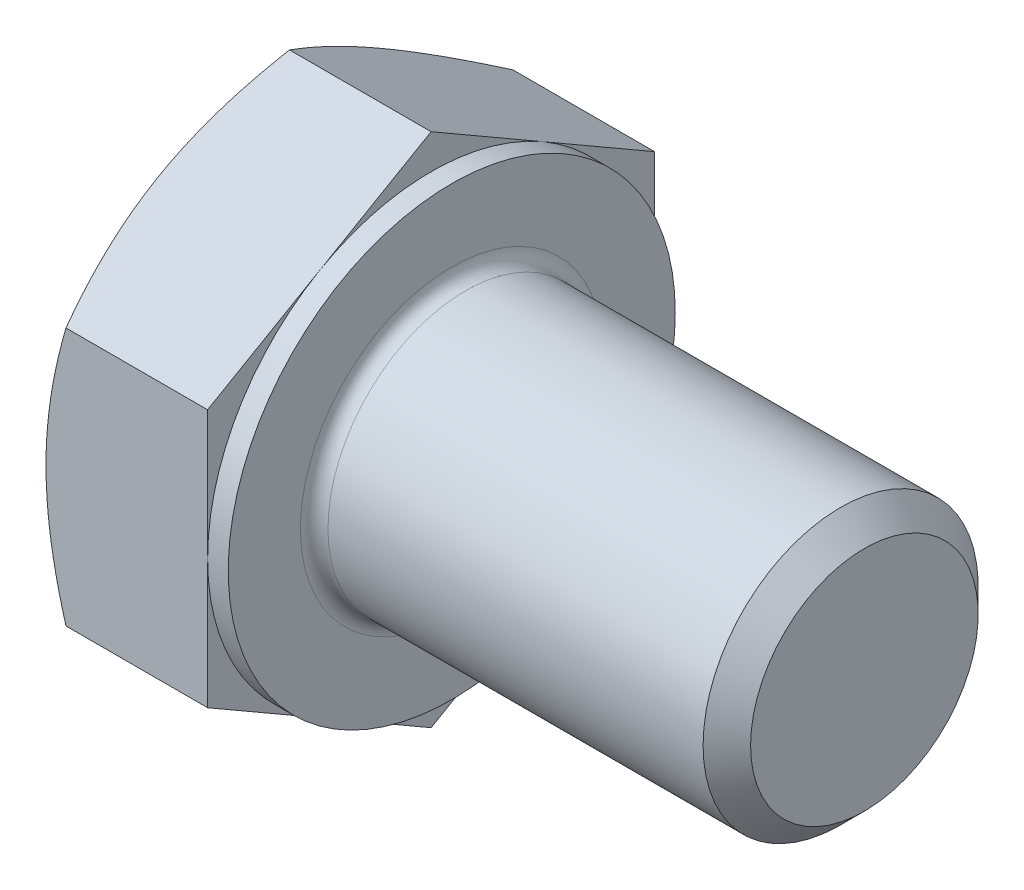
ISO-10303-21;
HEADER;
FILE_DESCRIPTION(('STEP AP214'),'2;1');
FILE_NAME('part.step','',(''),(''),'','','');
FILE_SCHEMA(('AUTOMOTIVE_DESIGN { 1 0 10303 214 1 1 1 1 }'));
ENDSEC;
DATA;
#1=APPLICATION_CONTEXT('core data for automotive mechanical design processes');
#2=APPLICATION_PROTOCOL_DEFINITION('international standard','automotive_design',2000,#1);
#3=PRODUCT_CONTEXT('',#1,'mechanical');
#4=PRODUCT('Part','Part','',(#3));
#5=PRODUCT_RELATED_PRODUCT_CATEGORY('part','',(#4));
#6=PRODUCT_DEFINITION_FORMATION('','',#4);
#7=PRODUCT_DEFINITION_CONTEXT('part definition',#1,'design');
#8=PRODUCT_DEFINITION('design','',#6,#7);
#9=PRODUCT_DEFINITION_SHAPE('','',#8);
#10=(LENGTH_UNIT() NAMED_UNIT(*) SI_UNIT(.MILLI.,.METRE.));
#11=(NAMED_UNIT(*) PLANE_ANGLE_UNIT() SI_UNIT($,.RADIAN.));
#12=(NAMED_UNIT(*) SI_UNIT($,.STERADIAN.) SOLID_ANGLE_UNIT());
#13=UNCERTAINTY_MEASURE_WITH_UNIT(LENGTH_MEASURE(1.E-05),#10,'distance_accuracy_value','');
#14=(GEOMETRIC_REPRESENTATION_CONTEXT(3) GLOBAL_UNCERTAINTY_ASSIGNED_CONTEXT((#13)) GLOBAL_UNIT_ASSIGNED_CONTEXT((#10,
#11,#12)) REPRESENTATION_CONTEXT('',''));
#15=CARTESIAN_POINT('',(0.,0.,0.));
#16=DIRECTION('',(0.,0.,1.));
#17=DIRECTION('',(1.,0.,0.));
#18=AXIS2_PLACEMENT_3D('',#15,#16,#17);
#19=CARTESIAN_POINT('',(5.3,7.50555349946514,0.));
#20=DIRECTION('',(1.,0.,0.));
#21=DIRECTION('',(0.,0.,-1.));
#22=AXIS2_PLACEMENT_3D('',#19,#20,#21);
#23=PLANE('',#22);
#24=CARTESIAN_POINT('',(5.3,0.,0.));
#25=DIRECTION('',(1.,0.,0.));
#26=DIRECTION('',(0.,0.,-1.));
#27=AXIS2_PLACEMENT_3D('',#24,#25,#26);
#28=CIRCLE('',#27,4.4);
#29=CARTESIAN_POINT('',(5.3,0.,-4.4));
#30=VERTEX_POINT('',#29);
#31=EDGE_CURVE('E43',#30,#30,#28,.F.);
#32=ORIENTED_EDGE('',*,*,#31,.T.);
#33=EDGE_LOOP('',(#32));
#34=FACE_BOUND('',#33,.T.);
#35=CARTESIAN_POINT('',(5.3,0.,0.));
#36=DIRECTION('',(1.,0.,0.));
#37=DIRECTION('',(0.,0.,-1.));
#38=AXIS2_PLACEMENT_3D('',#35,#36,#37);
#39=CIRCLE('',#38,6.5);
#40=CARTESIAN_POINT('',(5.3,0.,-6.5));
#41=VERTEX_POINT('',#40);
#42=EDGE_CURVE('E256',#41,#41,#39,.T.);
#43=ORIENTED_EDGE('',*,*,#42,.T.);
#44=EDGE_LOOP('',(#43));
#45=FACE_BOUND('',#44,.T.);
#46=ADVANCED_FACE('F34',(#34,#45),#23,.T.);
#47=CARTESIAN_POINT('',(0.,0.,0.));
#48=DIRECTION('',(-1.,0.,0.));
#49=DIRECTION('',(0.,0.,1.));
#50=AXIS2_PLACEMENT_3D('',#47,#48,#49);
#51=CYLINDRICAL_SURFACE('',#50,4.);
#52=CARTESIAN_POINT('',(5.7,0.,0.));
#53=DIRECTION('',(1.,0.,0.));
#54=DIRECTION('',(0.,0.,-1.));
#55=AXIS2_PLACEMENT_3D('',#52,#53,#54);
#56=CIRCLE('',#55,4.);
#57=CARTESIAN_POINT('',(5.7,0.,-4.));
#58=VERTEX_POINT('',#57);
#59=EDGE_CURVE('E11',#58,#58,#56,.T.);
#60=ORIENTED_EDGE('',*,*,#59,.T.);
#61=EDGE_LOOP('',(#60));
#62=FACE_BOUND('',#61,.T.);
#63=CARTESIAN_POINT('',(16.6095,0.,0.));
#64=DIRECTION('',(-1.,0.,0.));
#65=DIRECTION('',(0.,0.,1.));
#66=AXIS2_PLACEMENT_3D('',#63,#64,#65);
#67=CIRCLE('',#66,4.);
#68=CARTESIAN_POINT('',(16.6095,0.,4.));
#69=VERTEX_POINT('',#68);
#70=EDGE_CURVE('E300',#69,#69,#67,.T.);
#71=ORIENTED_EDGE('',*,*,#70,.T.);
#72=EDGE_LOOP('',(#71));
#73=FACE_BOUND('',#72,.T.);
#74=ADVANCED_FACE('F243',(#62,#73),#51,.T.);
#75=CARTESIAN_POINT('',(17.3,0.,0.));
#76=DIRECTION('',(-1.,0.,0.));
#77=DIRECTION('',(0.,0.,1.));
#78=AXIS2_PLACEMENT_3D('',#75,#76,#77);
#79=CONICAL_SURFACE('',#78,3.3095,0.785398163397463);
#80=ORIENTED_EDGE('',*,*,#70,.F.);
#81=EDGE_LOOP('',(#80));
#82=FACE_BOUND('',#81,.T.);
#83=CARTESIAN_POINT('',(17.3,0.,0.));
#84=DIRECTION('',(-1.,0.,0.));
#85=DIRECTION('',(0.,0.,1.));
#86=AXIS2_PLACEMENT_3D('',#83,#84,#85);
#87=CIRCLE('',#86,3.3095);
#88=CARTESIAN_POINT('',(17.3,0.,3.3095));
#89=VERTEX_POINT('',#88);
#90=EDGE_CURVE('E302',#89,#89,#87,.T.);
#91=ORIENTED_EDGE('',*,*,#90,.T.);
#92=EDGE_LOOP('',(#91));
#93=FACE_BOUND('',#92,.T.);
#94=ADVANCED_FACE('F248',(#82,#93),#79,.T.);
#95=CARTESIAN_POINT('',(17.3,0.,0.));
#96=DIRECTION('',(-1.,0.,0.));
#97=DIRECTION('',(0.,0.,1.));
#98=AXIS2_PLACEMENT_3D('',#95,#96,#97);
#99=PLANE('',#98);
#100=ORIENTED_EDGE('',*,*,#90,.F.);
#101=EDGE_LOOP('',(#100));
#102=FACE_BOUND('',#101,.T.);
#103=ADVANCED_FACE('F349',(#102),#99,.F.);
#104=CARTESIAN_POINT('',(4.7,6.5,0.));
#105=DIRECTION('',(1.,0.,0.));
#106=DIRECTION('',(0.,0.,-1.));
#107=AXIS2_PLACEMENT_3D('',#104,#105,#106);
#108=PLANE('',#107);
#109=DIRECTION('',(0.,0.500000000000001,0.866025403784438));
#110=VECTOR('',#109,1.);
#111=CARTESIAN_POINT('',(4.7,3.75277674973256,-6.5));
#112=LINE('',#111,#110);
#113=CARTESIAN_POINT('',(4.7,3.75277674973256,-6.5));
#114=VERTEX_POINT('',#113);
#115=CARTESIAN_POINT('',(4.7,5.62916512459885,-3.25));
#116=VERTEX_POINT('',#115);
#117=EDGE_CURVE('E167',#114,#116,#112,.T.);
#118=ORIENTED_EDGE('',*,*,#117,.T.);
#119=CARTESIAN_POINT('',(4.7,0.,0.));
#120=DIRECTION('',(-1.,0.,0.));
#121=DIRECTION('',(0.,0.,1.));
#122=AXIS2_PLACEMENT_3D('',#119,#120,#121);
#123=CIRCLE('',#122,6.5);
#124=CARTESIAN_POINT('',(4.7,0.,-6.5));
#125=VERTEX_POINT('',#124);
#126=EDGE_CURVE('E50',#116,#125,#123,.T.);
#127=ORIENTED_EDGE('',*,*,#126,.T.);
#128=DIRECTION('',(0.,1.,0.));
#129=VECTOR('',#128,1.);
#130=CARTESIAN_POINT('',(4.7,3.75277674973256,-6.5));
#131=LINE('',#130,#129);
#132=EDGE_CURVE('E257',#125,#114,#131,.T.);
#133=ORIENTED_EDGE('',*,*,#132,.T.);
#134=EDGE_LOOP('',(#118,#127,#133));
#135=FACE_BOUND('',#134,.T.);
#136=ADVANCED_FACE('F279',(#135),#108,.T.);
#137=CARTESIAN_POINT('',(4.7,7.50555349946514,0.));
#138=VERTEX_POINT('',#137);
#139=EDGE_CURVE('E165',#116,#138,#112,.T.);
#140=ORIENTED_EDGE('',*,*,#139,.T.);
#141=DIRECTION('',(0.,-0.500000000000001,0.866025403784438));
#142=VECTOR('',#141,1.);
#143=CARTESIAN_POINT('',(4.7,7.50555349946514,0.));
#144=LINE('',#143,#142);
#145=CARTESIAN_POINT('',(4.7,5.62916512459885,3.25));
#146=VERTEX_POINT('',#145);
#147=EDGE_CURVE('E164',#138,#146,#144,.T.);
#148=ORIENTED_EDGE('',*,*,#147,.T.);
#149=EDGE_CURVE('E153',#146,#116,#123,.T.);
#150=ORIENTED_EDGE('',*,*,#149,.T.);
#151=EDGE_LOOP('',(#140,#148,#150));
#152=FACE_BOUND('',#151,.T.);
#153=ADVANCED_FACE('F286',(#152),#108,.T.);
#154=CARTESIAN_POINT('',(4.7,3.75277674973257,6.5));
#155=VERTEX_POINT('',#154);
#156=EDGE_CURVE('E132',#146,#155,#144,.T.);
#157=ORIENTED_EDGE('',*,*,#156,.T.);
#158=DIRECTION('',(0.,-1.,0.));
#159=VECTOR('',#158,1.);
#160=CARTESIAN_POINT('',(4.7,3.75277674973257,6.5));
#161=LINE('',#160,#159);
#162=CARTESIAN_POINT('',(4.7,0.,6.5));
#163=VERTEX_POINT('',#162);
#164=EDGE_CURVE('E126',#155,#163,#161,.T.);
#165=ORIENTED_EDGE('',*,*,#164,.T.);
#166=EDGE_CURVE('E130',#163,#146,#123,.T.);
#167=ORIENTED_EDGE('',*,*,#166,.T.);
#168=EDGE_LOOP('',(#157,#165,#167));
#169=FACE_BOUND('',#168,.T.);
#170=ADVANCED_FACE('F128',(#169),#108,.T.);
#171=CARTESIAN_POINT('',(4.7,-3.75277674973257,6.5));
#172=VERTEX_POINT('',#171);
#173=EDGE_CURVE('E136',#163,#172,#161,.T.);
#174=ORIENTED_EDGE('',*,*,#173,.T.);
#175=DIRECTION('',(0.,-0.500000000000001,-0.866025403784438));
#176=VECTOR('',#175,1.);
#177=CARTESIAN_POINT('',(4.7,-7.50555349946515,0.));
#178=LINE('',#177,#176);
#179=CARTESIAN_POINT('',(4.7,-5.62916512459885,3.25000000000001));
#180=VERTEX_POINT('',#179);
#181=EDGE_CURVE('E143',#172,#180,#178,.T.);
#182=ORIENTED_EDGE('',*,*,#181,.T.);
#183=EDGE_CURVE('E140',#180,#163,#123,.T.);
#184=ORIENTED_EDGE('',*,*,#183,.T.);
#185=EDGE_LOOP('',(#174,#182,#184));
#186=FACE_BOUND('',#185,.T.);
#187=ADVANCED_FACE('F141',(#186),#108,.T.);
#188=CARTESIAN_POINT('',(4.7,-7.50555349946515,0.));
#189=VERTEX_POINT('',#188);
#190=EDGE_CURVE('E159',#180,#189,#178,.T.);
#191=ORIENTED_EDGE('',*,*,#190,.T.);
#192=DIRECTION('',(0.,0.5,-0.866025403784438));
#193=VECTOR('',#192,1.);
#194=CARTESIAN_POINT('',(4.7,-3.75277674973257,-6.5));
#195=LINE('',#194,#193);
#196=CARTESIAN_POINT('',(4.7,-5.62916512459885,-3.25));
#197=VERTEX_POINT('',#196);
#198=EDGE_CURVE('E340',#189,#197,#195,.T.);
#199=ORIENTED_EDGE('',*,*,#198,.T.);
#200=EDGE_CURVE('E147',#197,#180,#123,.T.);
#201=ORIENTED_EDGE('',*,*,#200,.T.);
#202=EDGE_LOOP('',(#191,#199,#201));
#203=FACE_BOUND('',#202,.T.);
#204=ADVANCED_FACE('F341',(#203),#108,.T.);
#205=CARTESIAN_POINT('',(4.7,-3.75277674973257,-6.5));
#206=VERTEX_POINT('',#205);
#207=EDGE_CURVE('E154',#197,#206,#195,.T.);
#208=ORIENTED_EDGE('',*,*,#207,.T.);
#209=EDGE_CURVE('E260',#206,#125,#131,.T.);
#210=ORIENTED_EDGE('',*,*,#209,.T.);
#211=EDGE_CURVE('E272',#125,#197,#123,.T.);
#212=ORIENTED_EDGE('',*,*,#211,.T.);
#213=EDGE_LOOP('',(#208,#210,#212));
#214=FACE_BOUND('',#213,.T.);
#215=ADVANCED_FACE('F271',(#214),#108,.T.);
#216=CARTESIAN_POINT('',(0.,0.,0.));
#217=DIRECTION('',(-1.,0.,0.));
#218=DIRECTION('',(0.,0.,1.));
#219=AXIS2_PLACEMENT_3D('',#216,#217,#218);
#220=CYLINDRICAL_SURFACE('',#219,6.5);
#221=ORIENTED_EDGE('',*,*,#126,.F.);
#222=ORIENTED_EDGE('',*,*,#149,.F.);
#223=ORIENTED_EDGE('',*,*,#166,.F.);
#224=ORIENTED_EDGE('',*,*,#183,.F.);
#225=ORIENTED_EDGE('',*,*,#200,.F.);
#226=ORIENTED_EDGE('',*,*,#211,.F.);
#227=EDGE_LOOP('',(#221,#222,#223,#224,#225,#226));
#228=FACE_BOUND('',#227,.T.);
#229=ORIENTED_EDGE('',*,*,#42,.F.);
#230=EDGE_LOOP('',(#229));
#231=FACE_BOUND('',#230,.T.);
#232=ADVANCED_FACE('F150',(#228,#231),#220,.T.);
#233=CARTESIAN_POINT('',(0.,7.50555349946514,0.));
#234=DIRECTION('',(1.,0.,0.));
#235=DIRECTION('',(0.,0.,-1.));
#236=AXIS2_PLACEMENT_3D('',#233,#234,#235);
#237=PLANE('',#236);
#238=CARTESIAN_POINT('',(0.,0.,0.));
#239=DIRECTION('',(1.,0.,0.));
#240=DIRECTION('',(0.,0.,-1.));
#241=AXIS2_PLACEMENT_3D('',#238,#239,#240);
#242=CIRCLE('',#241,6.5);
#243=CARTESIAN_POINT('',(0.,0.,-6.5));
#244=VERTEX_POINT('',#243);
#245=CARTESIAN_POINT('',(0.,5.62916512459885,-3.25000000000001));
#246=VERTEX_POINT('',#245);
#247=EDGE_CURVE('E258',#244,#246,#242,.T.);
#248=ORIENTED_EDGE('',*,*,#247,.F.);
#249=CARTESIAN_POINT('',(0.,-5.62916512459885,-3.25));
#250=VERTEX_POINT('',#249);
#251=EDGE_CURVE('E264',#250,#244,#242,.T.);
#252=ORIENTED_EDGE('',*,*,#251,.F.);
#253=CARTESIAN_POINT('',(0.,-5.62916512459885,3.25000000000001));
#254=VERTEX_POINT('',#253);
#255=EDGE_CURVE('E322',#254,#250,#242,.T.);
#256=ORIENTED_EDGE('',*,*,#255,.F.);
#257=CARTESIAN_POINT('',(0.,0.,6.5));
#258=VERTEX_POINT('',#257);
#259=EDGE_CURVE('E318',#258,#254,#242,.T.);
#260=ORIENTED_EDGE('',*,*,#259,.F.);
#261=CARTESIAN_POINT('',(0.,0.,0.));
#262=DIRECTION('',(-1.,0.,0.));
#263=DIRECTION('',(0.,0.,1.));
#264=AXIS2_PLACEMENT_3D('',#261,#262,#263);
#265=CIRCLE('',#264,6.5);
#266=CARTESIAN_POINT('',(0.,5.62916512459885,3.25));
#267=VERTEX_POINT('',#266);
#268=EDGE_CURVE('E168',#258,#267,#265,.T.);
#269=ORIENTED_EDGE('',*,*,#268,.T.);
#270=EDGE_CURVE('E262',#246,#267,#242,.T.);
#271=ORIENTED_EDGE('',*,*,#270,.F.);
#272=EDGE_LOOP('',(#248,#252,#256,#260,#269,#271));
#273=FACE_BOUND('',#272,.T.);
#274=ADVANCED_FACE('F319',(#273),#237,.F.);
#275=CARTESIAN_POINT('',(0.,0.,0.));
#276=DIRECTION('',(1.,0.,0.));
#277=DIRECTION('',(0.,0.,-1.));
#278=AXIS2_PLACEMENT_3D('',#275,#276,#277);
#279=CONICAL_SURFACE('',#278,6.5,1.0471975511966);
#280=CARTESIAN_POINT('',(0.580623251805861,3.75266127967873,6.5002));
#281=CARTESIAN_POINT('',(0.53300442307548,3.8351516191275,6.35732254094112));
#282=CARTESIAN_POINT('',(0.487546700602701,3.91794952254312,6.21391236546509));
#283=CARTESIAN_POINT('',(0.401548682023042,4.08421773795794,5.9259273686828));
#284=CARTESIAN_POINT('',(0.361010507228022,4.16768832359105,5.78135207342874));
#285=CARTESIAN_POINT('',(0.247571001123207,4.41943655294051,5.34531134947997));
#286=CARTESIAN_POINT('',(0.183047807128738,4.58870793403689,5.05212471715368));
#287=CARTESIAN_POINT('',(0.107386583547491,4.84201947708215,4.61337625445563));
#288=CARTESIAN_POINT('',(0.0858328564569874,4.92530276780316,4.46912536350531));
#289=CARTESIAN_POINT('',(0.0496903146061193,5.09224566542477,4.17997178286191));
#290=CARTESIAN_POINT('',(0.0351008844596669,5.17590523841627,4.03506915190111));
#291=CARTESIAN_POINT('',(0.0132587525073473,5.34336968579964,3.74501222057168));
#292=CARTESIAN_POINT('',(0.0059977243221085,5.427174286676,3.59985839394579));
#293=CARTESIAN_POINT('',(-0.00103969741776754,5.59485627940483,3.30942466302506));
#294=CARTESIAN_POINT('',(-0.000816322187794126,5.6787336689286,3.16414476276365));
#295=CARTESIAN_POINT('',(0.0100834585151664,5.90853103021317,2.76612405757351));
#296=CARTESIAN_POINT('',(0.0283818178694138,6.05437578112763,2.51351353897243));
#297=CARTESIAN_POINT('',(0.086406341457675,6.34509659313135,2.00997032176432));
#298=CARTESIAN_POINT('',(0.126152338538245,6.48997163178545,1.75903939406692));
#299=CARTESIAN_POINT('',(0.225505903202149,6.78127752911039,1.25448277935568));
#300=CARTESIAN_POINT('',(0.285534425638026,6.92767163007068,1.00092075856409));
#301=CARTESIAN_POINT('',(0.421774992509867,7.21827667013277,0.497578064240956));
#302=CARTESIAN_POINT('',(0.497955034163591,7.36249133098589,0.247790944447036));
#303=CARTESIAN_POINT('',(0.580623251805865,7.50566896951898,-0.000200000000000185));
#304=B_SPLINE_CURVE_WITH_KNOTS('',3,(#280,#281,#282,#283,#284,#285,#286,#287,#288,#289,#290,
#291,#292,#293,#294,#295,#296,#297,#298,#299,#300,#301,#302,#303),.UNSPECIFIED.,.F.,.F.,(4,2,2,
2,2,2,2,2,2,2,2,4),(0.,0.515105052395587,1.03043143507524,2.06322554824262,2.56697389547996,
3.07067772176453,3.57380860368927,4.07692394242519,4.9527935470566,5.82947446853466,
6.72559912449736,7.61996451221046),.UNSPECIFIED.);
#305=CARTESIAN_POINT('',(0.580556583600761,7.50555349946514,0.));
#306=VERTEX_POINT('',#305);
#307=EDGE_CURVE('E214',#267,#306,#304,.T.);
#308=ORIENTED_EDGE('',*,*,#307,.T.);
#309=CARTESIAN_POINT('',(0.580623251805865,7.50566896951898,0.000199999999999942));
#310=CARTESIAN_POINT('',(0.533004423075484,7.4231786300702,-0.14267745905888));
#311=CARTESIAN_POINT('',(0.487546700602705,7.34038072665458,-0.286087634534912));
#312=CARTESIAN_POINT('',(0.401548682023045,7.17411251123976,-0.574072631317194));
#313=CARTESIAN_POINT('',(0.361010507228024,7.09064192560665,-0.718647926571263));
#314=CARTESIAN_POINT('',(0.247571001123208,6.83889369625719,-1.15468865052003));
#315=CARTESIAN_POINT('',(0.18304780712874,6.66962231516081,-1.44787528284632));
#316=CARTESIAN_POINT('',(0.107386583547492,6.41631077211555,-1.88662374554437));
#317=CARTESIAN_POINT('',(0.0858328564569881,6.33302748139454,-2.03087463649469));
#318=CARTESIAN_POINT('',(0.0496903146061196,6.16608458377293,-2.32002821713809));
#319=CARTESIAN_POINT('',(0.0351008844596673,6.08242501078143,-2.46493084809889));
#320=CARTESIAN_POINT('',(0.0132587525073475,5.91496056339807,-2.75498777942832));
#321=CARTESIAN_POINT('',(0.00599772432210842,5.8311559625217,-2.90014160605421));
#322=CARTESIAN_POINT('',(-0.00103969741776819,5.66347396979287,-3.19057533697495));
#323=CARTESIAN_POINT('',(-0.000816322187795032,5.5795965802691,-3.33585523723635));
#324=CARTESIAN_POINT('',(0.0100834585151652,5.34979921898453,-3.73387594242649));
#325=CARTESIAN_POINT('',(0.0283818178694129,5.20395446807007,-3.98648646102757));
#326=CARTESIAN_POINT('',(0.0864063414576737,4.91323365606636,-4.49002967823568));
#327=CARTESIAN_POINT('',(0.126152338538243,4.76835861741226,-4.74096060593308));
#328=CARTESIAN_POINT('',(0.225505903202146,4.47705272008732,-5.24551722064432));
#329=CARTESIAN_POINT('',(0.285534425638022,4.33065861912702,-5.49907924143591));
#330=CARTESIAN_POINT('',(0.421774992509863,4.04005357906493,-6.00242193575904));
#331=CARTESIAN_POINT('',(0.497955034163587,3.89583891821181,-6.25220905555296));
#332=CARTESIAN_POINT('',(0.580623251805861,3.75266127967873,-6.5002));
#333=B_SPLINE_CURVE_WITH_KNOTS('',3,(#309,#310,#311,#312,#313,#314,#315,#316,#317,#318,#319,
#320,#321,#322,#323,#324,#325,#326,#327,#328,#329,#330,#331,#332),.UNSPECIFIED.,.F.,.F.,(4,2,2,
2,2,2,2,2,2,2,2,4),(0.,0.515105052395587,1.03043143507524,2.06322554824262,2.56697389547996,
3.07067772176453,3.57380860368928,4.0769239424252,4.9527935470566,5.82947446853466,
6.72559912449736,7.61996451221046),.UNSPECIFIED.);
#334=EDGE_CURVE('E58',#306,#246,#333,.T.);
#335=ORIENTED_EDGE('',*,*,#334,.T.);
#336=ORIENTED_EDGE('',*,*,#270,.T.);
#337=EDGE_LOOP('',(#308,#335,#336));
#338=FACE_BOUND('',#337,.T.);
#339=ADVANCED_FACE('F316',(#338),#279,.T.);
#340=CARTESIAN_POINT('',(3.18835311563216,-10.1137456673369,6.5));
#341=CARTESIAN_POINT('',(3.05034773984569,-9.82952666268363,6.5));
#342=CARTESIAN_POINT('',(2.91365616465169,-9.54465869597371,6.5));
#343=CARTESIAN_POINT('',(2.64363899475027,-8.9732797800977,6.5));
#344=CARTESIAN_POINT('',(2.51031392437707,-8.68676858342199,6.5));
#345=CARTESIAN_POINT('',(2.24710473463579,-8.11029837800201,6.5));
#346=CARTESIAN_POINT('',(2.11724300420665,-7.82032911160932,6.5));
#347=CARTESIAN_POINT('',(1.8627908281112,-7.23809540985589,6.5));
#348=CARTESIAN_POINT('',(1.73820013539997,-6.94583108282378,6.5));
#349=CARTESIAN_POINT('',(1.49176685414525,-6.34906440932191,6.5));
#350=CARTESIAN_POINT('',(1.37014257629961,-6.04447142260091,6.5));
#351=CARTESIAN_POINT('',(1.13601865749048,-5.43173420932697,6.5));
#352=CARTESIAN_POINT('',(1.02352003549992,-5.12358959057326,6.5));
#353=CARTESIAN_POINT('',(0.810575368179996,-4.50382569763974,6.5));
#354=CARTESIAN_POINT('',(0.71010523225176,-4.19221478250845,6.5));
#355=CARTESIAN_POINT('',(0.524420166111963,-3.56452019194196,6.5));
#356=CARTESIAN_POINT('',(0.439200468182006,-3.248437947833,6.5));
#357=CARTESIAN_POINT('',(0.288524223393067,-2.61335465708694,6.5));
#358=CARTESIAN_POINT('',(0.22296186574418,-2.29437912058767,6.5));
#359=CARTESIAN_POINT('',(0.115312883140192,-1.65238219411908,6.5));
#360=CARTESIAN_POINT('',(0.0732239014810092,-1.32936121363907,6.5));
#361=CARTESIAN_POINT('',(0.0304887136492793,-0.845231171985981,6.5));
#362=CARTESIAN_POINT('',(0.0196493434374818,-0.684982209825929,6.5));
#363=CARTESIAN_POINT('',(0.00475298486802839,-0.364162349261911,6.5));
#364=CARTESIAN_POINT('',(0.000695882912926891,-0.203591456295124,6.5));
#365=CARTESIAN_POINT('',(-0.000531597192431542,0.117577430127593,6.5));
#366=CARTESIAN_POINT('',(0.00229809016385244,0.278175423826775,6.5));
#367=CARTESIAN_POINT('',(0.0147726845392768,0.599108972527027,6.5));
#368=CARTESIAN_POINT('',(0.0244179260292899,0.759444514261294,6.5));
#369=CARTESIAN_POINT('',(0.0554961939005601,1.1436994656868,6.5));
#370=CARTESIAN_POINT('',(0.0801030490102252,1.36736763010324,6.5));
#371=CARTESIAN_POINT('',(0.141246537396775,1.81305591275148,6.5));
#372=CARTESIAN_POINT('',(0.177784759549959,2.035075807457,6.5));
#373=CARTESIAN_POINT('',(0.303360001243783,2.69839633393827,6.5));
#374=CARTESIAN_POINT('',(0.408335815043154,3.13672010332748,6.5));
#375=CARTESIAN_POINT('',(0.590564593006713,3.79232112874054,6.5));
#376=CARTESIAN_POINT('',(0.65631319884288,4.01299150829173,6.5));
#377=CARTESIAN_POINT('',(0.794681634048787,4.45218858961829,6.5));
#378=CARTESIAN_POINT('',(0.867301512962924,4.67071527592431,6.5));
#379=CARTESIAN_POINT('',(1.01824353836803,5.10569490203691,6.5));
#380=CARTESIAN_POINT('',(1.09656388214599,5.3221484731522,6.5));
#381=CARTESIAN_POINT('',(1.25798086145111,5.75325725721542,6.5));
#382=CARTESIAN_POINT('',(1.34107741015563,5.96791250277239,6.5));
#383=CARTESIAN_POINT('',(1.56029019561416,6.51888445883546,6.5));
#384=CARTESIAN_POINT('',(1.69936356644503,6.85402316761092,6.5));
#385=CARTESIAN_POINT('',(1.98501958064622,7.52109583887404,6.5));
#386=CARTESIAN_POINT('',(2.13160288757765,7.85302951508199,6.5));
#387=CARTESIAN_POINT('',(2.43059748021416,8.51437865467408,6.5));
#388=CARTESIAN_POINT('',(2.5830105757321,8.84379329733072,6.5));
#389=CARTESIAN_POINT('',(2.89234869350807,9.50047798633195,6.5));
#390=CARTESIAN_POINT('',(3.04927357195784,9.82774810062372,6.5));
#391=CARTESIAN_POINT('',(3.366920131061,10.4809971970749,6.5));
#392=CARTESIAN_POINT('',(3.5276467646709,10.8069737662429,6.5));
#393=CARTESIAN_POINT('',(3.85198555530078,11.4574882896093,6.5));
#394=CARTESIAN_POINT('',(4.01559773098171,11.7820262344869,6.5));
#395=CARTESIAN_POINT('',(4.50986184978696,12.753746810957,6.5));
#396=CARTESIAN_POINT('',(4.84399997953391,13.3991555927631,6.5));
#397=CARTESIAN_POINT('',(5.48575990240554,14.6239779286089,6.5));
#398=CARTESIAN_POINT('',(5.79279643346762,15.20369957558,6.5));
#399=CARTESIAN_POINT('',(6.41069188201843,16.3611382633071,6.5));
#400=CARTESIAN_POINT('',(6.72155098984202,16.9388552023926,6.5));
#401=CARTESIAN_POINT('',(7.34519775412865,18.0910273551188,6.5));
#402=CARTESIAN_POINT('',(7.65797694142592,18.6654871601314,6.5));
#403=CARTESIAN_POINT('',(8.28574397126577,19.8131486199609,6.5));
#404=CARTESIAN_POINT('',(8.6007316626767,20.3863503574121,6.5));
#405=CARTESIAN_POINT('',(8.91652967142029,20.9591024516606,6.5));
#406=B_SPLINE_CURVE_WITH_KNOTS('',3,(#340,#341,#342,#343,#344,#345,#346,#347,#348,#349,#350,
#351,#352,#353,#354,#355,#356,#357,#358,#359,#360,#361,#362,#363,#364,#365,#366,#367,#368,#369,
#370,#371,#372,#373,#374,#375,#376,#377,#378,#379,#380,#381,#382,#383,#384,#385,#386,#387,#388,
#389,#390,#391,#392,#393,#394,#395,#396,#397,#398,#399,#400,#401,#402,#403,#404,#405),
.UNSPECIFIED.,.F.,.F.,(4,2,2,2,2,2,2,2,2,2,2,2,2,2,2,2,2,2,2,2,2,2,2,2,2,2,2,2,2,2,2,2,4),(0.,
0.947868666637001,1.89588406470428,2.84900320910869,3.80207763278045,4.7858977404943,
5.76982755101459,6.75175256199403,7.73337005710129,8.70960474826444,9.68574140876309,
10.1674651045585,10.6491807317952,11.1309009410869,11.612644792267,12.2873175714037,
12.9620802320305,14.3123184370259,15.0030310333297,15.6937486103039,16.3842486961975,
17.074736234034,18.1631508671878,19.2516618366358,20.3405135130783,21.4293305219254,
22.519654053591,23.6099846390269,25.7902468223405,27.7582608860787,29.7263733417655,
31.6886408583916,33.6507753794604),.UNSPECIFIED.);
#407=CARTESIAN_POINT('',(0.580556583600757,3.75277674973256,6.5));
#408=VERTEX_POINT('',#407);
#409=EDGE_CURVE('E226',#258,#408,#406,.T.);
#410=ORIENTED_EDGE('',*,*,#409,.T.);
#411=EDGE_CURVE('E225',#408,#267,#304,.T.);
#412=ORIENTED_EDGE('',*,*,#411,.T.);
#413=ORIENTED_EDGE('',*,*,#268,.F.);
#414=EDGE_LOOP('',(#410,#412,#413));
#415=FACE_BOUND('',#414,.T.);
#416=ADVANCED_FACE('F313',(#415),#279,.T.);
#417=CARTESIAN_POINT('',(0.580556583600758,-3.75277674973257,6.5));
#418=VERTEX_POINT('',#417);
#419=EDGE_CURVE('E304',#418,#258,#406,.T.);
#420=ORIENTED_EDGE('',*,*,#419,.T.);
#421=ORIENTED_EDGE('',*,*,#259,.T.);
#422=CARTESIAN_POINT('',(0.580623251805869,-7.50566896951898,-0.000199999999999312));
#423=CARTESIAN_POINT('',(0.533004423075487,-7.42317863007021,0.142677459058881));
#424=CARTESIAN_POINT('',(0.487546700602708,-7.34038072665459,0.286087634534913));
#425=CARTESIAN_POINT('',(0.401548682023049,-7.17411251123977,0.574072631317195));
#426=CARTESIAN_POINT('',(0.361010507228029,-7.09064192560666,0.718647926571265));
#427=CARTESIAN_POINT('',(0.247571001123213,-6.8388936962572,1.15468865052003));
#428=CARTESIAN_POINT('',(0.183047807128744,-6.66962231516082,1.44787528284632));
#429=CARTESIAN_POINT('',(0.107386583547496,-6.41631077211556,1.88662374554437));
#430=CARTESIAN_POINT('',(0.0858328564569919,-6.33302748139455,2.03087463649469));
#431=CARTESIAN_POINT('',(0.0496903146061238,-6.16608458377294,2.32002821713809));
#432=CARTESIAN_POINT('',(0.0351008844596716,-6.08242501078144,2.46493084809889));
#433=CARTESIAN_POINT('',(0.0132587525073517,-5.91496056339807,2.75498777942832));
#434=CARTESIAN_POINT('',(0.00599772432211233,-5.83115596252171,2.90014160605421));
#435=CARTESIAN_POINT('',(-0.00103969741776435,-5.66347396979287,3.19057533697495));
#436=CARTESIAN_POINT('',(-0.000816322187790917,-5.57959658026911,3.33585523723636));
#437=CARTESIAN_POINT('',(0.0100834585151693,-5.34979921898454,3.73387594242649));
#438=CARTESIAN_POINT('',(0.0283818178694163,-5.20395446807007,3.98648646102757));
#439=CARTESIAN_POINT('',(0.0864063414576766,-4.91323365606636,4.49002967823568));
#440=CARTESIAN_POINT('',(0.126152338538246,-4.76835861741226,4.74096060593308));
#441=CARTESIAN_POINT('',(0.225505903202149,-4.47705272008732,5.24551722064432));
#442=CARTESIAN_POINT('',(0.285534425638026,-4.33065861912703,5.49907924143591));
#443=CARTESIAN_POINT('',(0.421774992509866,-4.04005357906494,6.00242193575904));
#444=CARTESIAN_POINT('',(0.497955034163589,-3.89583891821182,6.25220905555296));
#445=CARTESIAN_POINT('',(0.580623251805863,-3.75266127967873,6.5002));
#446=B_SPLINE_CURVE_WITH_KNOTS('',3,(#422,#423,#424,#425,#426,#427,#428,#429,#430,#431,#432,
#433,#434,#435,#436,#437,#438,#439,#440,#441,#442,#443,#444,#445),.UNSPECIFIED.,.F.,.F.,(4,2,2,
2,2,2,2,2,2,2,2,4),(0.,0.515105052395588,1.03043143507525,2.06322554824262,2.56697389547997,
3.07067772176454,3.57380860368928,4.0769239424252,4.9527935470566,5.82947446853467,
6.72559912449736,7.61996451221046),.UNSPECIFIED.);
#447=EDGE_CURVE('E216',#254,#418,#446,.T.);
#448=ORIENTED_EDGE('',*,*,#447,.T.);
#449=EDGE_LOOP('',(#420,#421,#448));
#450=FACE_BOUND('',#449,.T.);
#451=ADVANCED_FACE('F186',(#450),#279,.T.);
#452=CARTESIAN_POINT('',(0.580556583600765,-7.50555349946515,0.));
#453=VERTEX_POINT('',#452);
#454=EDGE_CURVE('E209',#453,#254,#446,.T.);
#455=ORIENTED_EDGE('',*,*,#454,.T.);
#456=ORIENTED_EDGE('',*,*,#255,.T.);
#457=CARTESIAN_POINT('',(0.580623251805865,-3.75266127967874,-6.5002));
#458=CARTESIAN_POINT('',(0.533004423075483,-3.83515161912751,-6.35732254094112));
#459=CARTESIAN_POINT('',(0.487546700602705,-3.91794952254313,-6.21391236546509));
#460=CARTESIAN_POINT('',(0.401548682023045,-4.08421773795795,-5.92592736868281));
#461=CARTESIAN_POINT('',(0.361010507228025,-4.16768832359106,-5.78135207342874));
#462=CARTESIAN_POINT('',(0.24757100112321,-4.41943655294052,-5.34531134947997));
#463=CARTESIAN_POINT('',(0.183047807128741,-4.5887079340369,-5.05212471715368));
#464=CARTESIAN_POINT('',(0.107386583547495,-4.84201947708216,-4.61337625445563));
#465=CARTESIAN_POINT('',(0.0858328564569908,-4.92530276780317,-4.46912536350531));
#466=CARTESIAN_POINT('',(0.0496903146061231,-5.09224566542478,-4.17997178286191));
#467=CARTESIAN_POINT('',(0.0351008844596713,-5.17590523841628,-4.03506915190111));
#468=CARTESIAN_POINT('',(0.0132587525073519,-5.34336968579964,-3.74501222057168));
#469=CARTESIAN_POINT('',(0.00599772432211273,-5.42717428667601,-3.59985839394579));
#470=CARTESIAN_POINT('',(-0.00103969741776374,-5.59485627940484,-3.30942466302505));
#471=CARTESIAN_POINT('',(-0.000816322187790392,-5.67873366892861,-3.16414476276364));
#472=CARTESIAN_POINT('',(0.0100834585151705,-5.90853103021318,-2.76612405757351));
#473=CARTESIAN_POINT('',(0.0283818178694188,-6.05437578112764,-2.51351353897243));
#474=CARTESIAN_POINT('',(0.0864063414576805,-6.34509659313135,-2.00997032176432));
#475=CARTESIAN_POINT('',(0.12615233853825,-6.48997163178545,-1.75903939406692));
#476=CARTESIAN_POINT('',(0.225505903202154,-6.78127752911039,-1.25448277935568));
#477=CARTESIAN_POINT('',(0.28553442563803,-6.92767163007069,-1.00092075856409));
#478=CARTESIAN_POINT('',(0.421774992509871,-7.21827667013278,-0.497578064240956));
#479=CARTESIAN_POINT('',(0.497955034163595,-7.3624913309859,-0.247790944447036));
#480=CARTESIAN_POINT('',(0.580623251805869,-7.50566896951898,0.000199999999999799));
#481=B_SPLINE_CURVE_WITH_KNOTS('',3,(#457,#458,#459,#460,#461,#462,#463,#464,#465,#466,#467,
#468,#469,#470,#471,#472,#473,#474,#475,#476,#477,#478,#479,#480),.UNSPECIFIED.,.F.,.F.,(4,2,2,
2,2,2,2,2,2,2,2,4),(0.,0.515105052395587,1.03043143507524,2.06322554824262,2.56697389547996,
3.07067772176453,3.57380860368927,4.0769239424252,4.9527935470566,5.82947446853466,
6.72559912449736,7.61996451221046),.UNSPECIFIED.);
#482=EDGE_CURVE('E215',#250,#453,#481,.T.);
#483=ORIENTED_EDGE('',*,*,#482,.T.);
#484=EDGE_LOOP('',(#455,#456,#483));
#485=FACE_BOUND('',#484,.T.);
#486=ADVANCED_FACE('F336',(#485),#279,.T.);
#487=CARTESIAN_POINT('',(0.580556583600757,3.75277674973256,-6.5));
#488=VERTEX_POINT('',#487);
#489=EDGE_CURVE('E217',#246,#488,#333,.T.);
#490=ORIENTED_EDGE('',*,*,#489,.T.);
#491=CARTESIAN_POINT('',(3.18835311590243,-10.1137456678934,-6.5));
#492=CARTESIAN_POINT('',(3.05034774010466,-9.82952666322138,-6.5));
#493=CARTESIAN_POINT('',(2.91365616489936,-9.54465869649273,-6.5));
#494=CARTESIAN_POINT('',(2.64363899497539,-8.97327978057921,-6.5));
#495=CARTESIAN_POINT('',(2.51031392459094,-8.68676858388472,-6.5));
#496=CARTESIAN_POINT('',(2.24710473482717,-8.11029837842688,-6.5));
#497=CARTESIAN_POINT('',(2.11724300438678,-7.82032911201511,-6.5));
#498=CARTESIAN_POINT('',(1.86279082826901,-7.23809541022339,-6.5));
#499=CARTESIAN_POINT('',(1.73820013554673,-6.94583108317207,-6.5));
#500=CARTESIAN_POINT('',(1.4917668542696,-6.34906440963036,-6.5));
#501=CARTESIAN_POINT('',(1.37014257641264,-6.04447142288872,-6.5));
#502=CARTESIAN_POINT('',(1.13601865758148,-5.43173420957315,-6.5));
#503=CARTESIAN_POINT('',(1.02352003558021,-5.12358959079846,-6.5));
#504=CARTESIAN_POINT('',(0.810575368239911,-4.50382569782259,-6.5));
#505=CARTESIAN_POINT('',(0.710105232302,-4.19221478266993,-6.5));
#506=CARTESIAN_POINT('',(0.52442016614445,-3.56452019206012,-6.5));
#507=CARTESIAN_POINT('',(0.439200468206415,-3.24843794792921,-6.5));
#508=CARTESIAN_POINT('',(0.288524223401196,-2.61335465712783,-6.5));
#509=CARTESIAN_POINT('',(0.222961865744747,-2.29437912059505,-6.5));
#510=CARTESIAN_POINT('',(0.115312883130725,-1.65238219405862,-6.5));
#511=CARTESIAN_POINT('',(0.0732239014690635,-1.3293612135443,-6.5));
#512=CARTESIAN_POINT('',(0.0304887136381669,-0.845231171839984,-6.5));
#513=CARTESIAN_POINT('',(0.0196493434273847,-0.684982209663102,-6.5));
#514=CARTESIAN_POINT('',(0.00475298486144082,-0.36416234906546,-6.5));
#515=CARTESIAN_POINT('',(0.000695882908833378,-0.203591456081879,-6.5));
#516=CARTESIAN_POINT('',(-0.000531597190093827,0.117577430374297,-6.5));
#517=CARTESIAN_POINT('',(0.00229809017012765,0.278175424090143,-6.5));
#518=CARTESIAN_POINT('',(0.0147726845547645,0.599108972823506,-6.5));
#519=CARTESIAN_POINT('',(0.0244179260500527,0.759444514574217,-6.5));
#520=CARTESIAN_POINT('',(0.0554961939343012,1.14369946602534,-6.5));
#521=CARTESIAN_POINT('',(0.0801030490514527,1.36736763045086,-6.5));
#522=CARTESIAN_POINT('',(0.141246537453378,1.81305591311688,-6.5));
#523=CARTESIAN_POINT('',(0.177784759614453,2.03507580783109,-6.5));
#524=CARTESIAN_POINT('',(0.303360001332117,2.69839633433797,-6.5));
#525=CARTESIAN_POINT('',(0.408335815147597,3.13672010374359,-6.5));
#526=CARTESIAN_POINT('',(0.590564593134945,3.79232112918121,-6.5));
#527=CARTESIAN_POINT('',(0.656313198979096,4.01299150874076,-6.5));
#528=CARTESIAN_POINT('',(0.794681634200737,4.45218859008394,-6.5));
#529=CARTESIAN_POINT('',(0.867301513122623,4.67071527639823,-6.5));
#530=CARTESIAN_POINT('',(1.01824353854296,5.1056949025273,-6.5));
#531=CARTESIAN_POINT('',(1.0965638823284,5.3221484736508,-6.5));
#532=CARTESIAN_POINT('',(1.25798086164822,5.75325725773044,-6.5));
#533=CARTESIAN_POINT('',(1.34107741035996,5.96791250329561,-6.5));
#534=CARTESIAN_POINT('',(1.56029019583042,6.51888445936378,-6.5));
#535=CARTESIAN_POINT('',(1.69936356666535,6.85402316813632,-6.5));
#536=CARTESIAN_POINT('',(1.98501958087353,7.52109583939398,-6.5));
#537=CARTESIAN_POINT('',(2.13160288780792,7.85302951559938,-6.5));
#538=CARTESIAN_POINT('',(2.43059748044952,8.51437865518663,-6.5));
#539=CARTESIAN_POINT('',(2.58301057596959,8.84379329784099,-6.5));
#540=CARTESIAN_POINT('',(2.89234869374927,9.50047798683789,-6.5));
#541=CARTESIAN_POINT('',(3.04927357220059,9.82774810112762,-6.5));
#542=CARTESIAN_POINT('',(3.36692013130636,10.4809971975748,-6.5));
#543=CARTESIAN_POINT('',(3.52764676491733,10.8069737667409,-6.5));
#544=CARTESIAN_POINT('',(3.85198555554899,11.4574882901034,-6.5));
#545=CARTESIAN_POINT('',(4.01559773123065,11.7820262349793,-6.5));
#546=CARTESIAN_POINT('',(4.50986185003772,12.7537468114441,-6.5));
#547=CARTESIAN_POINT('',(4.84399997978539,13.3991555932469,-6.5));
#548=CARTESIAN_POINT('',(5.48575990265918,14.6239779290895,-6.5));
#549=CARTESIAN_POINT('',(5.79279643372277,15.2036995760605,-6.5));
#550=CARTESIAN_POINT('',(6.41069188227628,16.3611382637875,-6.5));
#551=CARTESIAN_POINT('',(6.72155099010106,16.9388552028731,-6.5));
#552=CARTESIAN_POINT('',(7.34519775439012,18.0910273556,-6.5));
#553=CARTESIAN_POINT('',(7.65797694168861,18.6654871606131,-6.5));
#554=CARTESIAN_POINT('',(8.28574397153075,19.8131486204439,-6.5));
#555=CARTESIAN_POINT('',(8.60073166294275,20.3863503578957,-6.5));
#556=CARTESIAN_POINT('',(8.91652967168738,20.9591024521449,-6.49999999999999));
#557=B_SPLINE_CURVE_WITH_KNOTS('',3,(#491,#492,#493,#494,#495,#496,#497,#498,#499,#500,#501,
#502,#503,#504,#505,#506,#507,#508,#509,#510,#511,#512,#513,#514,#515,#516,#517,#518,#519,#520,
#521,#522,#523,#524,#525,#526,#527,#528,#529,#530,#531,#532,#533,#534,#535,#536,#537,#538,#539,
#540,#541,#542,#543,#544,#545,#546,#547,#548,#549,#550,#551,#552,#553,#554,#555,#556),
.UNSPECIFIED.,.F.,.F.,(4,2,2,2,2,2,2,2,2,2,2,2,2,2,2,2,2,2,2,2,2,2,2,2,2,2,2,2,2,2,2,2,4),(0.,
0.947868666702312,1.89588406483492,2.84900320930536,3.80207763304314,4.7858977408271,
5.76982755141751,6.75175256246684,7.73337005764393,8.7096047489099,9.68574140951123,
10.1674651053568,10.6491807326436,11.1309009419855,11.6126447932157,12.287317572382,
12.9620802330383,14.312318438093,15.0030310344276,15.6937486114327,16.3842486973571,
17.0747362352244,18.1631508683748,19.2516618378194,20.3405135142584,21.429330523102,
22.5196540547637,23.6099846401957,25.7902468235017,27.7582608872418,29.7263733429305,
31.6886408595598,33.6507753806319),.UNSPECIFIED.);
#558=EDGE_CURVE('E179',#488,#244,#557,.F.);
#559=ORIENTED_EDGE('',*,*,#558,.T.);
#560=ORIENTED_EDGE('',*,*,#247,.T.);
#561=EDGE_LOOP('',(#490,#559,#560));
#562=FACE_BOUND('',#561,.T.);
#563=ADVANCED_FACE('F333',(#562),#279,.T.);
#564=CARTESIAN_POINT('',(0.580556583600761,-3.75277674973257,-6.5));
#565=VERTEX_POINT('',#564);
#566=EDGE_CURVE('E180',#565,#250,#481,.T.);
#567=ORIENTED_EDGE('',*,*,#566,.T.);
#568=ORIENTED_EDGE('',*,*,#251,.T.);
#569=EDGE_CURVE('E171',#244,#565,#557,.F.);
#570=ORIENTED_EDGE('',*,*,#569,.T.);
#571=EDGE_LOOP('',(#567,#568,#570));
#572=FACE_BOUND('',#571,.T.);
#573=ADVANCED_FACE('F195',(#572),#279,.T.);
#574=CARTESIAN_POINT('',(5.3,3.75277674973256,-6.5));
#575=DIRECTION('',(0.,0.,1.));
#576=DIRECTION('',(0.,-1.,0.));
#577=AXIS2_PLACEMENT_3D('',#574,#575,#576);
#578=PLANE('',#577);
#579=ORIENTED_EDGE('',*,*,#209,.F.);
#580=DIRECTION('',(-1.,0.,0.));
#581=VECTOR('',#580,1.);
#582=CARTESIAN_POINT('',(5.3,-3.75277674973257,-6.5));
#583=LINE('',#582,#581);
#584=EDGE_CURVE('E297',#206,#565,#583,.T.);
#585=ORIENTED_EDGE('',*,*,#584,.T.);
#586=ORIENTED_EDGE('',*,*,#569,.F.);
#587=ORIENTED_EDGE('',*,*,#558,.F.);
#588=DIRECTION('',(-1.,0.,0.));
#589=VECTOR('',#588,1.);
#590=CARTESIAN_POINT('',(5.3,3.75277674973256,-6.5));
#591=LINE('',#590,#589);
#592=EDGE_CURVE('E277',#114,#488,#591,.T.);
#593=ORIENTED_EDGE('',*,*,#592,.F.);
#594=ORIENTED_EDGE('',*,*,#132,.F.);
#595=EDGE_LOOP('',(#579,#585,#586,#587,#593,#594));
#596=FACE_BOUND('',#595,.T.);
#597=ADVANCED_FACE('F190',(#596),#578,.F.);
#598=CARTESIAN_POINT('',(5.3,-3.75277674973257,-6.5));
#599=DIRECTION('',(0.,0.866025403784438,0.5));
#600=DIRECTION('',(0.,-0.5,0.866025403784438));
#601=AXIS2_PLACEMENT_3D('',#598,#599,#600);
#602=PLANE('',#601);
#603=ORIENTED_EDGE('',*,*,#198,.F.);
#604=DIRECTION('',(-1.,0.,0.));
#605=VECTOR('',#604,1.);
#606=CARTESIAN_POINT('',(5.3,-7.50555349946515,0.));
#607=LINE('',#606,#605);
#608=EDGE_CURVE('E293',#189,#453,#607,.T.);
#609=ORIENTED_EDGE('',*,*,#608,.T.);
#610=ORIENTED_EDGE('',*,*,#482,.F.);
#611=ORIENTED_EDGE('',*,*,#566,.F.);
#612=ORIENTED_EDGE('',*,*,#584,.F.);
#613=ORIENTED_EDGE('',*,*,#207,.F.);
#614=EDGE_LOOP('',(#603,#609,#610,#611,#612,#613));
#615=FACE_BOUND('',#614,.T.);
#616=ADVANCED_FACE('F194',(#615),#602,.F.);
#617=CARTESIAN_POINT('',(5.3,-7.50555349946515,0.));
#618=DIRECTION('',(0.,0.866025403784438,-0.500000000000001));
#619=DIRECTION('',(0.,0.500000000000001,0.866025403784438));
#620=AXIS2_PLACEMENT_3D('',#617,#618,#619);
#621=PLANE('',#620);
#622=ORIENTED_EDGE('',*,*,#181,.F.);
#623=DIRECTION('',(-1.,0.,0.));
#624=VECTOR('',#623,1.);
#625=CARTESIAN_POINT('',(5.3,-3.75277674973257,6.5));
#626=LINE('',#625,#624);
#627=EDGE_CURVE('E158',#172,#418,#626,.T.);
#628=ORIENTED_EDGE('',*,*,#627,.T.);
#629=ORIENTED_EDGE('',*,*,#447,.F.);
#630=ORIENTED_EDGE('',*,*,#454,.F.);
#631=ORIENTED_EDGE('',*,*,#608,.F.);
#632=ORIENTED_EDGE('',*,*,#190,.F.);
#633=EDGE_LOOP('',(#622,#628,#629,#630,#631,#632));
#634=FACE_BOUND('',#633,.T.);
#635=ADVANCED_FACE('F201',(#634),#621,.F.);
#636=CARTESIAN_POINT('',(5.3,3.75277674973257,6.5));
#637=DIRECTION('',(0.,0.,-1.));
#638=DIRECTION('',(-1.,0.,0.));
#639=AXIS2_PLACEMENT_3D('',#636,#637,#638);
#640=PLANE('',#639);
#641=ORIENTED_EDGE('',*,*,#164,.F.);
#642=DIRECTION('',(-1.,0.,0.));
#643=VECTOR('',#642,1.);
#644=CARTESIAN_POINT('',(5.3,3.75277674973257,6.5));
#645=LINE('',#644,#643);
#646=EDGE_CURVE('E289',#155,#408,#645,.T.);
#647=ORIENTED_EDGE('',*,*,#646,.T.);
#648=ORIENTED_EDGE('',*,*,#409,.F.);
#649=ORIENTED_EDGE('',*,*,#419,.F.);
#650=ORIENTED_EDGE('',*,*,#627,.F.);
#651=ORIENTED_EDGE('',*,*,#173,.F.);
#652=EDGE_LOOP('',(#641,#647,#648,#649,#650,#651));
#653=FACE_BOUND('',#652,.T.);
#654=ADVANCED_FACE('F156',(#653),#640,.F.);
#655=CARTESIAN_POINT('',(5.3,7.50555349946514,0.));
#656=DIRECTION('',(0.,-0.866025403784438,-0.500000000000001));
#657=DIRECTION('',(0.,0.500000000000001,-0.866025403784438));
#658=AXIS2_PLACEMENT_3D('',#655,#656,#657);
#659=PLANE('',#658);
#660=ORIENTED_EDGE('',*,*,#147,.F.);
#661=DIRECTION('',(-1.,0.,0.));
#662=VECTOR('',#661,1.);
#663=CARTESIAN_POINT('',(5.3,7.50555349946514,0.));
#664=LINE('',#663,#662);
#665=EDGE_CURVE('E284',#138,#306,#664,.T.);
#666=ORIENTED_EDGE('',*,*,#665,.T.);
#667=ORIENTED_EDGE('',*,*,#307,.F.);
#668=ORIENTED_EDGE('',*,*,#411,.F.);
#669=ORIENTED_EDGE('',*,*,#646,.F.);
#670=ORIENTED_EDGE('',*,*,#156,.F.);
#671=EDGE_LOOP('',(#660,#666,#667,#668,#669,#670));
#672=FACE_BOUND('',#671,.T.);
#673=ADVANCED_FACE('F231',(#672),#659,.F.);
#674=CARTESIAN_POINT('',(5.3,3.75277674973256,-6.5));
#675=DIRECTION('',(0.,-0.866025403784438,0.500000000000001));
#676=DIRECTION('',(0.,-0.500000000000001,-0.866025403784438));
#677=AXIS2_PLACEMENT_3D('',#674,#675,#676);
#678=PLANE('',#677);
#679=ORIENTED_EDGE('',*,*,#117,.F.);
#680=ORIENTED_EDGE('',*,*,#592,.T.);
#681=ORIENTED_EDGE('',*,*,#489,.F.);
#682=ORIENTED_EDGE('',*,*,#334,.F.);
#683=ORIENTED_EDGE('',*,*,#665,.F.);
#684=ORIENTED_EDGE('',*,*,#139,.F.);
#685=EDGE_LOOP('',(#679,#680,#681,#682,#683,#684));
#686=FACE_BOUND('',#685,.T.);
#687=ADVANCED_FACE('F36',(#686),#678,.F.);
#688=CARTESIAN_POINT('',(5.7,0.,0.));
#689=DIRECTION('',(1.,0.,0.));
#690=DIRECTION('',(0.,0.,-1.));
#691=AXIS2_PLACEMENT_3D('',#688,#689,#690);
#692=TOROIDAL_SURFACE('',#691,4.4,0.4);
#693=ORIENTED_EDGE('',*,*,#59,.F.);
#694=EDGE_LOOP('',(#693));
#695=FACE_BOUND('',#694,.T.);
#696=ORIENTED_EDGE('',*,*,#31,.F.);
#697=EDGE_LOOP('',(#696));
#698=FACE_BOUND('',#697,.T.);
#699=ADVANCED_FACE('F239',(#695,#698),#692,.F.);
#700=CLOSED_SHELL('',(#46,#74,#94,#103,#136,#153,#170,#187,#204,#215,#232,#274,#339,#416,#451,
#486,#563,#573,#597,#616,#635,#654,#673,#687,#699));
#701=MANIFOLD_SOLID_BREP('B2',#700);
#702=ADVANCED_BREP_SHAPE_REPRESENTATION('',(#18,#701),#14);
#703=SHAPE_DEFINITION_REPRESENTATION(#9,#702);
ENDSEC;
END-ISO-10303-21;
